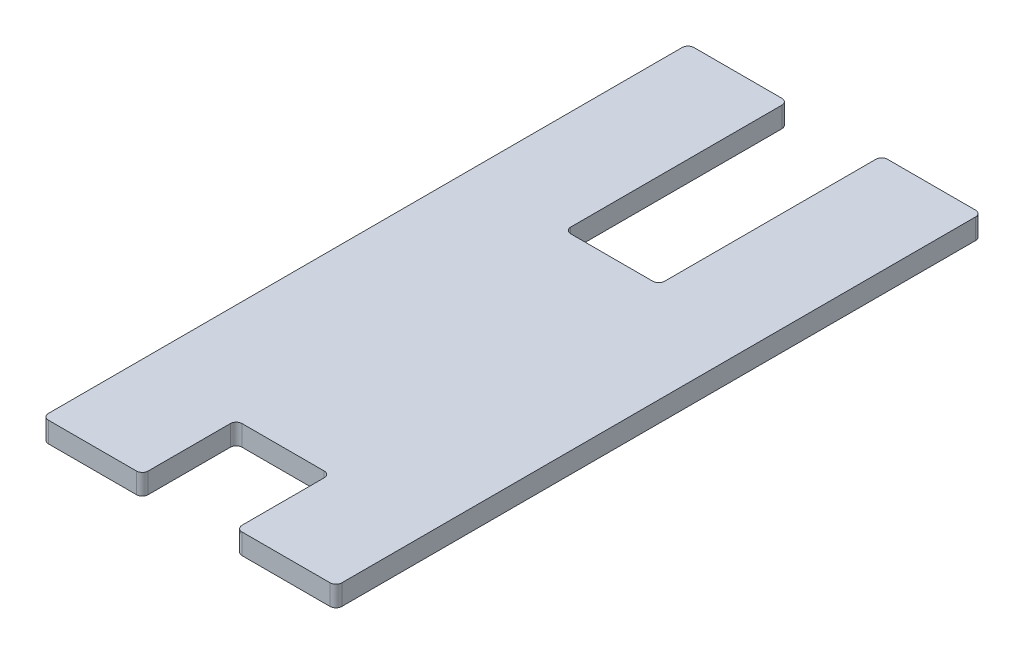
from build123d import *

# Parameters (mm, degrees)
EXTRUDE_1_DEPTH = 3.5
FILLET_1_R      = 1


with BuildPart() as part:
    # Sketch 1 → Extrude 1 (new body)
    with BuildSketch(Plane(origin=(0, 0, 0), x_dir=(1, 0, 0), z_dir=(0, 1, 0))):
        Polygon((8, 0), (25, 0), (25, 110), (8, 110), (8, 72), (-8, 72), (-8, 110), (-25, 110), (-25, 0), (-8, 0), (-8, 16), (8, 16), align=None)
    extrude(amount=EXTRUDE_1_DEPTH)

    # Fillet 1
    fillet_1_edges = [part.edges().sort_by_distance(p)[0] for p in [
        (-25, 1.75, -110),
        (-8, 1.75, -110),
        (-8, 1.75, -72),
        (8, 1.75, -72),
        (8, 1.75, -110),
        (25, 1.75, -110),
        (25, 1.75, 0),
        (8, 1.75, 0),
        (8, 1.75, -16),
        (-8, 1.75, -16),
        (-8, 1.75, 0),
        (-25, 1.75, 0),
    ]]
    fillet(fillet_1_edges, radius=FILLET_1_R)


solid = part.part
